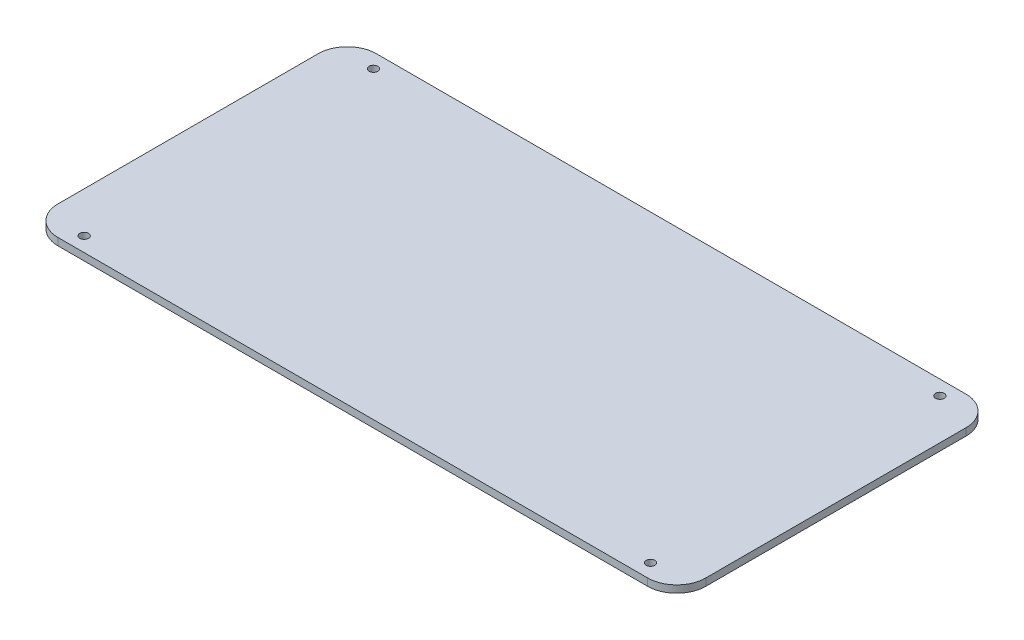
from build123d import *

# Parameters (mm, degrees)
SKETCH1_W               = 222.81
SKETCH1_H               = 109.5
BOSS_EXTRUDE1_DEPTH     = 2.5
FILLET1_R               = 10
CUT_EXTRUDE4_DEPTH      = 8
CUT_EXTRUDE4_DEPTH_BACK = 4.5
SKETCH2_R               = 1.5


with BuildPart() as part:
    # Sketch1 → Boss-Extrude1 (new body)
    with BuildSketch(Plane(origin=(0, 0, 0), x_dir=(1, 0, 0), z_dir=(0, 1, 0))):
        Rectangle(SKETCH1_W, SKETCH1_H)
    extrude(amount=BOSS_EXTRUDE1_DEPTH)

    # Fillet1
    fillet1_edges = [part.edges().sort_by_distance(p)[0] for p in [
        (111.405, 1.25, 54.75),
        (-111.405, 1.25, 54.75),
        (-111.405, 1.25, -54.75),
        (111.405, 1.25, -54.75),
    ]]
    fillet(fillet1_edges, radius=FILLET1_R)

    # Sketch2 → Cut-Extrude4 (cut, two sides: drawn at the far end of the back side and taken through both)
    with BuildSketch(Plane(origin=(0, 0, 0), x_dir=(1, 0, 0), z_dir=(0, 1, 0)).offset(-CUT_EXTRUDE4_DEPTH_BACK)):
        with Locations(Location((-97.405, 49.75, 0), (0, 0, 270))):
            Circle(SKETCH2_R)
        with Locations(Location((-97.405, -49.75, 0), (0, 0, 270))):
            Circle(SKETCH2_R)
        with Locations(Location((97.405, 49.75, 0), (0, 0, 270))):
            Circle(SKETCH2_R)
        with Locations(Location((97.405, -49.75, 0), (0, 0, 270))):
            Circle(SKETCH2_R)
    extrude(amount=CUT_EXTRUDE4_DEPTH + CUT_EXTRUDE4_DEPTH_BACK, mode=Mode.SUBTRACT)


solid = part.part
